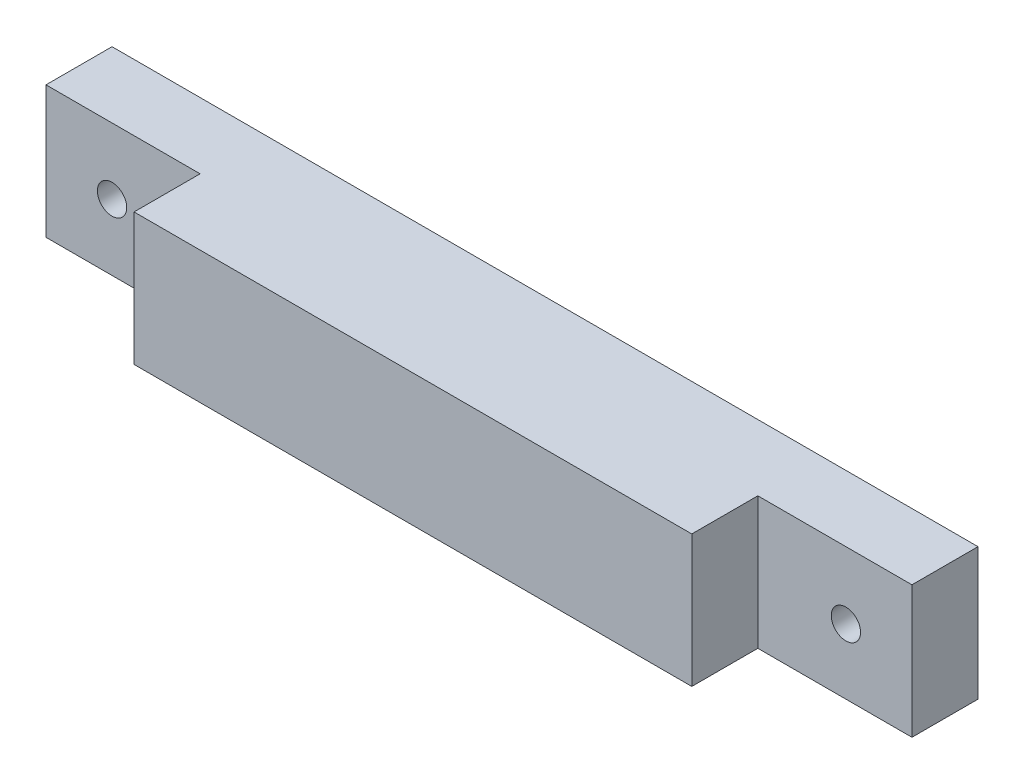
ISO-10303-21;
HEADER;
FILE_DESCRIPTION(('STEP AP214'),'2;1');
FILE_NAME('part.step','',(''),(''),'','','');
FILE_SCHEMA(('AUTOMOTIVE_DESIGN { 1 0 10303 214 1 1 1 1 }'));
ENDSEC;
DATA;
#1=APPLICATION_CONTEXT('core data for automotive mechanical design processes');
#2=APPLICATION_PROTOCOL_DEFINITION('international standard','automotive_design',2000,#1);
#3=PRODUCT_CONTEXT('',#1,'mechanical');
#4=PRODUCT('Part','Part','',(#3));
#5=PRODUCT_RELATED_PRODUCT_CATEGORY('part','',(#4));
#6=PRODUCT_DEFINITION_FORMATION('','',#4);
#7=PRODUCT_DEFINITION_CONTEXT('part definition',#1,'design');
#8=PRODUCT_DEFINITION('design','',#6,#7);
#9=PRODUCT_DEFINITION_SHAPE('','',#8);
#10=(LENGTH_UNIT() NAMED_UNIT(*) SI_UNIT(.MILLI.,.METRE.));
#11=(NAMED_UNIT(*) PLANE_ANGLE_UNIT() SI_UNIT($,.RADIAN.));
#12=(NAMED_UNIT(*) SI_UNIT($,.STERADIAN.) SOLID_ANGLE_UNIT());
#13=UNCERTAINTY_MEASURE_WITH_UNIT(LENGTH_MEASURE(1.E-05),#10,'distance_accuracy_value','');
#14=(GEOMETRIC_REPRESENTATION_CONTEXT(3) GLOBAL_UNCERTAINTY_ASSIGNED_CONTEXT((#13)) GLOBAL_UNIT_ASSIGNED_CONTEXT((#10,
#11,#12)) REPRESENTATION_CONTEXT('',''));
#15=CARTESIAN_POINT('',(0.,0.,0.));
#16=DIRECTION('',(0.,0.,1.));
#17=DIRECTION('',(1.,0.,0.));
#18=AXIS2_PLACEMENT_3D('',#15,#16,#17);
#19=CARTESIAN_POINT('',(59.,0.,9.));
#20=DIRECTION('',(-1.,0.,0.));
#21=DIRECTION('',(0.,0.,1.));
#22=AXIS2_PLACEMENT_3D('',#19,#20,#21);
#23=PLANE('',#22);
#24=DIRECTION('',(0.,1.,0.));
#25=VECTOR('',#24,1.);
#26=CARTESIAN_POINT('',(59.,0.,4.5));
#27=LINE('',#26,#25);
#28=CARTESIAN_POINT('',(59.,0.,4.5));
#29=VERTEX_POINT('',#28);
#30=CARTESIAN_POINT('',(59.,9.,4.5));
#31=VERTEX_POINT('',#30);
#32=EDGE_CURVE('E96',#29,#31,#27,.T.);
#33=ORIENTED_EDGE('',*,*,#32,.F.);
#34=DIRECTION('',(0.,0.,-1.));
#35=VECTOR('',#34,1.);
#36=CARTESIAN_POINT('',(59.,0.,9.));
#37=LINE('',#36,#35);
#38=CARTESIAN_POINT('',(59.,0.,0.));
#39=VERTEX_POINT('',#38);
#40=EDGE_CURVE('E39',#29,#39,#37,.T.);
#41=ORIENTED_EDGE('',*,*,#40,.T.);
#42=DIRECTION('',(0.,1.,0.));
#43=VECTOR('',#42,1.);
#44=CARTESIAN_POINT('',(59.,0.,0.));
#45=LINE('',#44,#43);
#46=CARTESIAN_POINT('',(59.,9.,0.));
#47=VERTEX_POINT('',#46);
#48=EDGE_CURVE('E117',#39,#47,#45,.T.);
#49=ORIENTED_EDGE('',*,*,#48,.T.);
#50=DIRECTION('',(0.,0.,-1.));
#51=VECTOR('',#50,1.);
#52=CARTESIAN_POINT('',(59.,9.,9.));
#53=LINE('',#52,#51);
#54=EDGE_CURVE('E112',#31,#47,#53,.T.);
#55=ORIENTED_EDGE('',*,*,#54,.F.);
#56=EDGE_LOOP('',(#33,#41,#49,#55));
#57=FACE_BOUND('',#56,.T.);
#58=ADVANCED_FACE('F31',(#57),#23,.F.);
#59=CARTESIAN_POINT('',(0.,0.,9.));
#60=DIRECTION('',(1.,0.,0.));
#61=DIRECTION('',(0.,0.,-1.));
#62=AXIS2_PLACEMENT_3D('',#59,#60,#61);
#63=PLANE('',#62);
#64=DIRECTION('',(0.,-1.,0.));
#65=VECTOR('',#64,1.);
#66=CARTESIAN_POINT('',(0.,9.,4.5));
#67=LINE('',#66,#65);
#68=CARTESIAN_POINT('',(0.,9.,4.5));
#69=VERTEX_POINT('',#68);
#70=CARTESIAN_POINT('',(0.,0.,4.5));
#71=VERTEX_POINT('',#70);
#72=EDGE_CURVE('E144',#69,#71,#67,.T.);
#73=ORIENTED_EDGE('',*,*,#72,.F.);
#74=DIRECTION('',(0.,0.,-1.));
#75=VECTOR('',#74,1.);
#76=CARTESIAN_POINT('',(0.,9.,9.));
#77=LINE('',#76,#75);
#78=CARTESIAN_POINT('',(0.,9.,0.));
#79=VERTEX_POINT('',#78);
#80=EDGE_CURVE('E119',#69,#79,#77,.T.);
#81=ORIENTED_EDGE('',*,*,#80,.T.);
#82=DIRECTION('',(0.,-1.,0.));
#83=VECTOR('',#82,1.);
#84=CARTESIAN_POINT('',(0.,0.,0.));
#85=LINE('',#84,#83);
#86=CARTESIAN_POINT('',(0.,0.,0.));
#87=VERTEX_POINT('',#86);
#88=EDGE_CURVE('E131',#79,#87,#85,.T.);
#89=ORIENTED_EDGE('',*,*,#88,.T.);
#90=DIRECTION('',(0.,0.,-1.));
#91=VECTOR('',#90,1.);
#92=CARTESIAN_POINT('',(0.,0.,9.));
#93=LINE('',#92,#91);
#94=EDGE_CURVE('E11',#71,#87,#93,.T.);
#95=ORIENTED_EDGE('',*,*,#94,.F.);
#96=EDGE_LOOP('',(#73,#81,#89,#95));
#97=FACE_BOUND('',#96,.T.);
#98=ADVANCED_FACE('F33',(#97),#63,.F.);
#99=CARTESIAN_POINT('',(0.,0.,9.));
#100=DIRECTION('',(0.,1.,0.));
#101=DIRECTION('',(0.,0.,1.));
#102=AXIS2_PLACEMENT_3D('',#99,#100,#101);
#103=PLANE('',#102);
#104=DIRECTION('',(1.,0.,0.));
#105=VECTOR('',#104,1.);
#106=CARTESIAN_POINT('',(59.,0.,4.5));
#107=LINE('',#106,#105);
#108=CARTESIAN_POINT('',(48.5,0.,4.5));
#109=VERTEX_POINT('',#108);
#110=EDGE_CURVE('E102',#109,#29,#107,.T.);
#111=ORIENTED_EDGE('',*,*,#110,.F.);
#112=DIRECTION('',(0.,0.,1.));
#113=VECTOR('',#112,1.);
#114=CARTESIAN_POINT('',(48.5,0.,4.5));
#115=LINE('',#114,#113);
#116=CARTESIAN_POINT('',(48.5,0.,9.));
#117=VERTEX_POINT('',#116);
#118=EDGE_CURVE('E145',#109,#117,#115,.T.);
#119=ORIENTED_EDGE('',*,*,#118,.T.);
#120=DIRECTION('',(1.,0.,0.));
#121=VECTOR('',#120,1.);
#122=CARTESIAN_POINT('',(0.,0.,9.));
#123=LINE('',#122,#121);
#124=CARTESIAN_POINT('',(10.5,0.,9.));
#125=VERTEX_POINT('',#124);
#126=EDGE_CURVE('E126',#125,#117,#123,.T.);
#127=ORIENTED_EDGE('',*,*,#126,.F.);
#128=DIRECTION('',(0.,0.,1.));
#129=VECTOR('',#128,1.);
#130=CARTESIAN_POINT('',(10.5,0.,4.5));
#131=LINE('',#130,#129);
#132=CARTESIAN_POINT('',(10.5,0.,4.5));
#133=VERTEX_POINT('',#132);
#134=EDGE_CURVE('E54',#133,#125,#131,.T.);
#135=ORIENTED_EDGE('',*,*,#134,.F.);
#136=DIRECTION('',(1.,0.,0.));
#137=VECTOR('',#136,1.);
#138=CARTESIAN_POINT('',(0.,0.,4.5));
#139=LINE('',#138,#137);
#140=EDGE_CURVE('E150',#71,#133,#139,.T.);
#141=ORIENTED_EDGE('',*,*,#140,.F.);
#142=ORIENTED_EDGE('',*,*,#94,.T.);
#143=DIRECTION('',(1.,0.,0.));
#144=VECTOR('',#143,1.);
#145=CARTESIAN_POINT('',(0.,0.,0.));
#146=LINE('',#145,#144);
#147=EDGE_CURVE('E128',#87,#39,#146,.T.);
#148=ORIENTED_EDGE('',*,*,#147,.T.);
#149=ORIENTED_EDGE('',*,*,#40,.F.);
#150=EDGE_LOOP('',(#111,#119,#127,#135,#141,#142,#148,#149));
#151=FACE_BOUND('',#150,.T.);
#152=ADVANCED_FACE('F199',(#151),#103,.F.);
#153=CARTESIAN_POINT('',(0.,9.,9.));
#154=DIRECTION('',(0.,-1.,0.));
#155=DIRECTION('',(0.,0.,-1.));
#156=AXIS2_PLACEMENT_3D('',#153,#154,#155);
#157=PLANE('',#156);
#158=DIRECTION('',(-1.,0.,0.));
#159=VECTOR('',#158,1.);
#160=CARTESIAN_POINT('',(0.,9.,9.));
#161=LINE('',#160,#159);
#162=CARTESIAN_POINT('',(48.5,9.,9.));
#163=VERTEX_POINT('',#162);
#164=CARTESIAN_POINT('',(10.5,9.,9.));
#165=VERTEX_POINT('',#164);
#166=EDGE_CURVE('E121',#163,#165,#161,.T.);
#167=ORIENTED_EDGE('',*,*,#166,.F.);
#168=DIRECTION('',(0.,0.,1.));
#169=VECTOR('',#168,1.);
#170=CARTESIAN_POINT('',(48.5,9.,4.5));
#171=LINE('',#170,#169);
#172=CARTESIAN_POINT('',(48.5,9.,4.5));
#173=VERTEX_POINT('',#172);
#174=EDGE_CURVE('E46',#173,#163,#171,.T.);
#175=ORIENTED_EDGE('',*,*,#174,.F.);
#176=DIRECTION('',(-1.,0.,0.));
#177=VECTOR('',#176,1.);
#178=CARTESIAN_POINT('',(59.,9.,4.5));
#179=LINE('',#178,#177);
#180=EDGE_CURVE('E100',#31,#173,#179,.T.);
#181=ORIENTED_EDGE('',*,*,#180,.F.);
#182=ORIENTED_EDGE('',*,*,#54,.T.);
#183=DIRECTION('',(-1.,0.,0.));
#184=VECTOR('',#183,1.);
#185=CARTESIAN_POINT('',(0.,9.,0.));
#186=LINE('',#185,#184);
#187=EDGE_CURVE('E124',#47,#79,#186,.T.);
#188=ORIENTED_EDGE('',*,*,#187,.T.);
#189=ORIENTED_EDGE('',*,*,#80,.F.);
#190=DIRECTION('',(-1.,0.,0.));
#191=VECTOR('',#190,1.);
#192=CARTESIAN_POINT('',(0.,9.,4.5));
#193=LINE('',#192,#191);
#194=CARTESIAN_POINT('',(10.5,9.,4.5));
#195=VERTEX_POINT('',#194);
#196=EDGE_CURVE('E139',#195,#69,#193,.T.);
#197=ORIENTED_EDGE('',*,*,#196,.F.);
#198=DIRECTION('',(0.,0.,1.));
#199=VECTOR('',#198,1.);
#200=CARTESIAN_POINT('',(10.5,9.,4.5));
#201=LINE('',#200,#199);
#202=EDGE_CURVE('E134',#195,#165,#201,.T.);
#203=ORIENTED_EDGE('',*,*,#202,.T.);
#204=EDGE_LOOP('',(#167,#175,#181,#182,#188,#189,#197,#203));
#205=FACE_BOUND('',#204,.T.);
#206=ADVANCED_FACE('F110',(#205),#157,.F.);
#207=CARTESIAN_POINT('',(0.,9.,9.));
#208=DIRECTION('',(0.,0.,-1.));
#209=DIRECTION('',(-1.,0.,0.));
#210=AXIS2_PLACEMENT_3D('',#207,#208,#209);
#211=PLANE('',#210);
#212=ORIENTED_EDGE('',*,*,#126,.T.);
#213=DIRECTION('',(0.,-1.,0.));
#214=VECTOR('',#213,1.);
#215=CARTESIAN_POINT('',(48.5,0.,9.));
#216=LINE('',#215,#214);
#217=EDGE_CURVE('E106',#163,#117,#216,.T.);
#218=ORIENTED_EDGE('',*,*,#217,.F.);
#219=ORIENTED_EDGE('',*,*,#166,.T.);
#220=DIRECTION('',(0.,1.,0.));
#221=VECTOR('',#220,1.);
#222=CARTESIAN_POINT('',(10.5,9.,9.));
#223=LINE('',#222,#221);
#224=EDGE_CURVE('E142',#125,#165,#223,.T.);
#225=ORIENTED_EDGE('',*,*,#224,.F.);
#226=EDGE_LOOP('',(#212,#218,#219,#225));
#227=FACE_BOUND('',#226,.T.);
#228=ADVANCED_FACE('F208',(#227),#211,.F.);
#229=CARTESIAN_POINT('',(0.,9.,0.));
#230=DIRECTION('',(0.,0.,-1.));
#231=DIRECTION('',(-1.,0.,0.));
#232=AXIS2_PLACEMENT_3D('',#229,#230,#231);
#233=PLANE('',#232);
#234=CARTESIAN_POINT('',(54.5,4.43705983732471,0.));
#235=DIRECTION('',(0.,0.,1.));
#236=DIRECTION('',(1.,0.,0.));
#237=AXIS2_PLACEMENT_3D('',#234,#235,#236);
#238=CIRCLE('',#237,0.999999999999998);
#239=CARTESIAN_POINT('',(55.5,4.43705983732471,0.));
#240=VERTEX_POINT('',#239);
#241=EDGE_CURVE('E164',#240,#240,#238,.T.);
#242=ORIENTED_EDGE('',*,*,#241,.T.);
#243=EDGE_LOOP('',(#242));
#244=FACE_BOUND('',#243,.T.);
#245=CARTESIAN_POINT('',(4.5,4.5,0.));
#246=DIRECTION('',(0.,0.,1.));
#247=DIRECTION('',(1.,0.,0.));
#248=AXIS2_PLACEMENT_3D('',#245,#246,#247);
#249=CIRCLE('',#248,1.);
#250=CARTESIAN_POINT('',(5.5,4.5,0.));
#251=VERTEX_POINT('',#250);
#252=EDGE_CURVE('E158',#251,#251,#249,.T.);
#253=ORIENTED_EDGE('',*,*,#252,.T.);
#254=EDGE_LOOP('',(#253));
#255=FACE_BOUND('',#254,.T.);
#256=ORIENTED_EDGE('',*,*,#88,.F.);
#257=ORIENTED_EDGE('',*,*,#187,.F.);
#258=ORIENTED_EDGE('',*,*,#48,.F.);
#259=ORIENTED_EDGE('',*,*,#147,.F.);
#260=EDGE_LOOP('',(#256,#257,#258,#259));
#261=FACE_BOUND('',#260,.T.);
#262=ADVANCED_FACE('F173',(#244,#255,#261),#233,.T.);
#263=CARTESIAN_POINT('',(10.5,9.,4.5));
#264=DIRECTION('',(1.,0.,0.));
#265=DIRECTION('',(0.,1.,0.));
#266=AXIS2_PLACEMENT_3D('',#263,#264,#265);
#267=PLANE('',#266);
#268=ORIENTED_EDGE('',*,*,#224,.T.);
#269=ORIENTED_EDGE('',*,*,#202,.F.);
#270=DIRECTION('',(0.,1.,0.));
#271=VECTOR('',#270,1.);
#272=CARTESIAN_POINT('',(10.5,9.,4.5));
#273=LINE('',#272,#271);
#274=EDGE_CURVE('E147',#133,#195,#273,.T.);
#275=ORIENTED_EDGE('',*,*,#274,.F.);
#276=ORIENTED_EDGE('',*,*,#134,.T.);
#277=EDGE_LOOP('',(#268,#269,#275,#276));
#278=FACE_BOUND('',#277,.T.);
#279=ADVANCED_FACE('F220',(#278),#267,.F.);
#280=CARTESIAN_POINT('',(0.,0.,4.5));
#281=DIRECTION('',(0.,0.,1.));
#282=DIRECTION('',(1.,0.,0.));
#283=AXIS2_PLACEMENT_3D('',#280,#281,#282);
#284=PLANE('',#283);
#285=CARTESIAN_POINT('',(4.5,4.5,4.5));
#286=DIRECTION('',(0.,0.,1.));
#287=DIRECTION('',(1.,0.,0.));
#288=AXIS2_PLACEMENT_3D('',#285,#286,#287);
#289=CIRCLE('',#288,1.);
#290=CARTESIAN_POINT('',(5.5,4.5,4.5));
#291=VERTEX_POINT('',#290);
#292=EDGE_CURVE('E161',#291,#291,#289,.T.);
#293=ORIENTED_EDGE('',*,*,#292,.F.);
#294=EDGE_LOOP('',(#293));
#295=FACE_BOUND('',#294,.T.);
#296=ORIENTED_EDGE('',*,*,#72,.T.);
#297=ORIENTED_EDGE('',*,*,#140,.T.);
#298=ORIENTED_EDGE('',*,*,#274,.T.);
#299=ORIENTED_EDGE('',*,*,#196,.T.);
#300=EDGE_LOOP('',(#296,#297,#298,#299));
#301=FACE_BOUND('',#300,.T.);
#302=ADVANCED_FACE('F192',(#295,#301),#284,.T.);
#303=CARTESIAN_POINT('',(48.5,0.,4.5));
#304=DIRECTION('',(-1.,0.,0.));
#305=DIRECTION('',(0.,0.,1.));
#306=AXIS2_PLACEMENT_3D('',#303,#304,#305);
#307=PLANE('',#306);
#308=ORIENTED_EDGE('',*,*,#217,.T.);
#309=ORIENTED_EDGE('',*,*,#118,.F.);
#310=DIRECTION('',(0.,-1.,0.));
#311=VECTOR('',#310,1.);
#312=CARTESIAN_POINT('',(48.5,0.,4.5));
#313=LINE('',#312,#311);
#314=EDGE_CURVE('E114',#173,#109,#313,.T.);
#315=ORIENTED_EDGE('',*,*,#314,.F.);
#316=ORIENTED_EDGE('',*,*,#174,.T.);
#317=EDGE_LOOP('',(#308,#309,#315,#316));
#318=FACE_BOUND('',#317,.T.);
#319=ADVANCED_FACE('F184',(#318),#307,.F.);
#320=CARTESIAN_POINT('',(59.,9.,4.5));
#321=DIRECTION('',(0.,0.,1.));
#322=DIRECTION('',(1.,0.,0.));
#323=AXIS2_PLACEMENT_3D('',#320,#321,#322);
#324=PLANE('',#323);
#325=CARTESIAN_POINT('',(54.5,4.43705983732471,4.5));
#326=DIRECTION('',(0.,0.,1.));
#327=DIRECTION('',(1.,0.,0.));
#328=AXIS2_PLACEMENT_3D('',#325,#326,#327);
#329=CIRCLE('',#328,0.999999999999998);
#330=CARTESIAN_POINT('',(55.5,4.43705983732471,4.5));
#331=VERTEX_POINT('',#330);
#332=EDGE_CURVE('E167',#331,#331,#329,.T.);
#333=ORIENTED_EDGE('',*,*,#332,.F.);
#334=EDGE_LOOP('',(#333));
#335=FACE_BOUND('',#334,.T.);
#336=ORIENTED_EDGE('',*,*,#32,.T.);
#337=ORIENTED_EDGE('',*,*,#180,.T.);
#338=ORIENTED_EDGE('',*,*,#314,.T.);
#339=ORIENTED_EDGE('',*,*,#110,.T.);
#340=EDGE_LOOP('',(#336,#337,#338,#339));
#341=FACE_BOUND('',#340,.T.);
#342=ADVANCED_FACE('F98',(#335,#341),#324,.T.);
#343=CARTESIAN_POINT('',(4.5,4.5,0.));
#344=DIRECTION('',(0.,0.,1.));
#345=DIRECTION('',(1.,0.,0.));
#346=AXIS2_PLACEMENT_3D('',#343,#344,#345);
#347=CYLINDRICAL_SURFACE('',#346,1.);
#348=ORIENTED_EDGE('',*,*,#252,.F.);
#349=EDGE_LOOP('',(#348));
#350=FACE_BOUND('',#349,.T.);
#351=ORIENTED_EDGE('',*,*,#292,.T.);
#352=EDGE_LOOP('',(#351));
#353=FACE_BOUND('',#352,.T.);
#354=ADVANCED_FACE('F179',(#350,#353),#347,.F.);
#355=CARTESIAN_POINT('',(54.5,4.43705983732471,0.));
#356=DIRECTION('',(0.,0.,1.));
#357=DIRECTION('',(1.,0.,0.));
#358=AXIS2_PLACEMENT_3D('',#355,#356,#357);
#359=CYLINDRICAL_SURFACE('',#358,0.999999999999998);
#360=ORIENTED_EDGE('',*,*,#241,.F.);
#361=EDGE_LOOP('',(#360));
#362=FACE_BOUND('',#361,.T.);
#363=ORIENTED_EDGE('',*,*,#332,.T.);
#364=EDGE_LOOP('',(#363));
#365=FACE_BOUND('',#364,.T.);
#366=ADVANCED_FACE('F176',(#362,#365),#359,.F.);
#367=CLOSED_SHELL('',(#58,#98,#152,#206,#228,#262,#279,#302,#319,#342,#354,#366));
#368=MANIFOLD_SOLID_BREP('B2',#367);
#369=ADVANCED_BREP_SHAPE_REPRESENTATION('',(#18,#368),#14);
#370=SHAPE_DEFINITION_REPRESENTATION(#9,#369);
ENDSEC;
END-ISO-10303-21;
